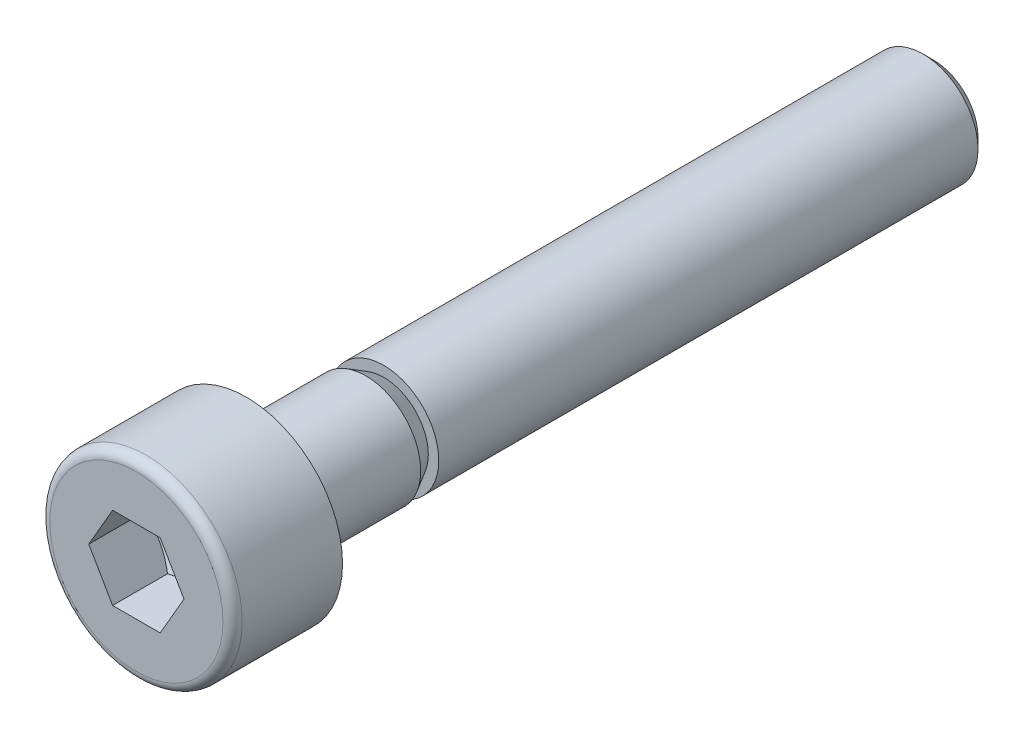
ISO-10303-21;
HEADER;
FILE_DESCRIPTION(('STEP AP214'),'2;1');
FILE_NAME('part.step','',(''),(''),'','','');
FILE_SCHEMA(('AUTOMOTIVE_DESIGN { 1 0 10303 214 1 1 1 1 }'));
ENDSEC;
DATA;
#1=APPLICATION_CONTEXT('core data for automotive mechanical design processes');
#2=APPLICATION_PROTOCOL_DEFINITION('international standard','automotive_design',2000,#1);
#3=PRODUCT_CONTEXT('',#1,'mechanical');
#4=PRODUCT('Part','Part','',(#3));
#5=PRODUCT_RELATED_PRODUCT_CATEGORY('part','',(#4));
#6=PRODUCT_DEFINITION_FORMATION('','',#4);
#7=PRODUCT_DEFINITION_CONTEXT('part definition',#1,'design');
#8=PRODUCT_DEFINITION('design','',#6,#7);
#9=PRODUCT_DEFINITION_SHAPE('','',#8);
#10=(LENGTH_UNIT() NAMED_UNIT(*) SI_UNIT(.MILLI.,.METRE.));
#11=(NAMED_UNIT(*) PLANE_ANGLE_UNIT() SI_UNIT($,.RADIAN.));
#12=(NAMED_UNIT(*) SI_UNIT($,.STERADIAN.) SOLID_ANGLE_UNIT());
#13=UNCERTAINTY_MEASURE_WITH_UNIT(LENGTH_MEASURE(1.E-05),#10,'distance_accuracy_value','');
#14=(GEOMETRIC_REPRESENTATION_CONTEXT(3) GLOBAL_UNCERTAINTY_ASSIGNED_CONTEXT((#13)) GLOBAL_UNIT_ASSIGNED_CONTEXT((#10,
#11,#12)) REPRESENTATION_CONTEXT('',''));
#15=CARTESIAN_POINT('',(0.,0.,0.));
#16=DIRECTION('',(0.,0.,1.));
#17=DIRECTION('',(1.,0.,0.));
#18=AXIS2_PLACEMENT_3D('',#15,#16,#17);
#19=CARTESIAN_POINT('',(0.,0.,4.));
#20=DIRECTION('',(0.,0.,1.));
#21=DIRECTION('',(1.,0.,0.));
#22=AXIS2_PLACEMENT_3D('',#19,#20,#21);
#23=PLANE('',#22);
#24=CARTESIAN_POINT('',(0.,0.,4.));
#25=DIRECTION('',(0.,0.,1.));
#26=DIRECTION('',(1.,0.,0.));
#27=AXIS2_PLACEMENT_3D('',#24,#25,#26);
#28=CIRCLE('',#27,3.15);
#29=CARTESIAN_POINT('',(3.15,0.,4.));
#30=VERTEX_POINT('',#29);
#31=EDGE_CURVE('E118',#30,#30,#28,.T.);
#32=ORIENTED_EDGE('',*,*,#31,.T.);
#33=EDGE_LOOP('',(#32));
#34=FACE_BOUND('',#33,.T.);
#35=DIRECTION('',(1.,0.,0.));
#36=VECTOR('',#35,1.);
#37=CARTESIAN_POINT('',(-0.866025,1.49999930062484,4.));
#38=LINE('',#37,#36);
#39=CARTESIAN_POINT('',(-0.866025,1.49999930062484,4.));
#40=VERTEX_POINT('',#39);
#41=CARTESIAN_POINT('',(0.866025,1.49999930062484,4.));
#42=VERTEX_POINT('',#41);
#43=EDGE_CURVE('E95',#40,#42,#38,.T.);
#44=ORIENTED_EDGE('',*,*,#43,.T.);
#45=DIRECTION('',(0.5,-0.866025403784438,0.));
#46=VECTOR('',#45,1.);
#47=CARTESIAN_POINT('',(0.866025,1.49999930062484,4.));
#48=LINE('',#47,#46);
#49=CARTESIAN_POINT('',(1.73205,0.,4.));
#50=VERTEX_POINT('',#49);
#51=EDGE_CURVE('E32',#42,#50,#48,.T.);
#52=ORIENTED_EDGE('',*,*,#51,.T.);
#53=DIRECTION('',(-0.5,-0.866025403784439,0.));
#54=VECTOR('',#53,1.);
#55=CARTESIAN_POINT('',(1.73205,0.,4.));
#56=LINE('',#55,#54);
#57=CARTESIAN_POINT('',(0.866025,-1.49999930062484,4.));
#58=VERTEX_POINT('',#57);
#59=EDGE_CURVE('E375',#50,#58,#56,.T.);
#60=ORIENTED_EDGE('',*,*,#59,.T.);
#61=DIRECTION('',(-1.,0.,0.));
#62=VECTOR('',#61,1.);
#63=CARTESIAN_POINT('',(0.866025,-1.49999930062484,4.));
#64=LINE('',#63,#62);
#65=CARTESIAN_POINT('',(-0.866025,-1.49999930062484,4.));
#66=VERTEX_POINT('',#65);
#67=EDGE_CURVE('E379',#58,#66,#64,.T.);
#68=ORIENTED_EDGE('',*,*,#67,.T.);
#69=DIRECTION('',(-0.5,0.866025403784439,0.));
#70=VECTOR('',#69,1.);
#71=CARTESIAN_POINT('',(-0.866025,-1.49999930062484,4.));
#72=LINE('',#71,#70);
#73=CARTESIAN_POINT('',(-1.73205,0.,4.));
#74=VERTEX_POINT('',#73);
#75=EDGE_CURVE('E383',#66,#74,#72,.T.);
#76=ORIENTED_EDGE('',*,*,#75,.T.);
#77=DIRECTION('',(0.5,0.866025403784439,0.));
#78=VECTOR('',#77,1.);
#79=CARTESIAN_POINT('',(-1.73205,0.,4.));
#80=LINE('',#79,#78);
#81=EDGE_CURVE('E104',#74,#40,#80,.T.);
#82=ORIENTED_EDGE('',*,*,#81,.T.);
#83=EDGE_LOOP('',(#44,#52,#60,#68,#76,#82));
#84=FACE_BOUND('',#83,.T.);
#85=ADVANCED_FACE('F16',(#34,#84),#23,.T.);
#86=CARTESIAN_POINT('',(0.,1.621125,-25.));
#87=DIRECTION('',(0.,0.,-1.));
#88=DIRECTION('',(-1.,0.,0.));
#89=AXIS2_PLACEMENT_3D('',#86,#87,#88);
#90=PLANE('',#89);
#91=CARTESIAN_POINT('',(0.,0.,-25.));
#92=DIRECTION('',(0.,0.,1.));
#93=DIRECTION('',(1.,0.,0.));
#94=AXIS2_PLACEMENT_3D('',#91,#92,#93);
#95=CIRCLE('',#94,1.621125);
#96=CARTESIAN_POINT('',(1.621125,0.,-25.));
#97=VERTEX_POINT('',#96);
#98=EDGE_CURVE('E11',#97,#97,#95,.T.);
#99=ORIENTED_EDGE('',*,*,#98,.F.);
#100=EDGE_LOOP('',(#99));
#101=FACE_BOUND('',#100,.T.);
#102=ADVANCED_FACE('F18',(#101),#90,.T.);
#103=CARTESIAN_POINT('',(0.,0.,-24.621125));
#104=DIRECTION('',(0.,0.,1.));
#105=DIRECTION('',(1.,0.,0.));
#106=AXIS2_PLACEMENT_3D('',#103,#104,#105);
#107=CONICAL_SURFACE('',#106,2.,0.785398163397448);
#108=ORIENTED_EDGE('',*,*,#98,.T.);
#109=EDGE_LOOP('',(#108));
#110=FACE_BOUND('',#109,.T.);
#111=CARTESIAN_POINT('',(0.,0.,-24.621125));
#112=DIRECTION('',(0.,0.,1.));
#113=DIRECTION('',(1.,0.,0.));
#114=AXIS2_PLACEMENT_3D('',#111,#112,#113);
#115=CIRCLE('',#114,2.);
#116=CARTESIAN_POINT('',(2.,0.,-24.621125));
#117=VERTEX_POINT('',#116);
#118=EDGE_CURVE('E25',#117,#117,#115,.T.);
#119=ORIENTED_EDGE('',*,*,#118,.F.);
#120=EDGE_LOOP('',(#119));
#121=FACE_BOUND('',#120,.T.);
#122=ADVANCED_FACE('F159',(#110,#121),#107,.T.);
#123=CARTESIAN_POINT('',(0.,0.,4.));
#124=DIRECTION('',(0.,0.,1.));
#125=DIRECTION('',(1.,0.,0.));
#126=AXIS2_PLACEMENT_3D('',#123,#124,#125);
#127=CYLINDRICAL_SURFACE('',#126,2.);
#128=ORIENTED_EDGE('',*,*,#118,.T.);
#129=EDGE_LOOP('',(#128));
#130=FACE_BOUND('',#129,.T.);
#131=CARTESIAN_POINT('',(0.,0.,-5.));
#132=DIRECTION('',(0.,0.,1.));
#133=DIRECTION('',(1.,0.,0.));
#134=AXIS2_PLACEMENT_3D('',#131,#132,#133);
#135=CIRCLE('',#134,2.);
#136=CARTESIAN_POINT('',(2.,0.,-5.));
#137=VERTEX_POINT('',#136);
#138=EDGE_CURVE('E146',#137,#137,#135,.T.);
#139=ORIENTED_EDGE('',*,*,#138,.F.);
#140=EDGE_LOOP('',(#139));
#141=FACE_BOUND('',#140,.T.);
#142=ADVANCED_FACE('F156',(#130,#141),#127,.T.);
#143=CARTESIAN_POINT('',(0.,1.621125,-5.));
#144=DIRECTION('',(0.,0.,1.));
#145=DIRECTION('',(1.,0.,0.));
#146=AXIS2_PLACEMENT_3D('',#143,#144,#145);
#147=PLANE('',#146);
#148=ORIENTED_EDGE('',*,*,#138,.T.);
#149=EDGE_LOOP('',(#148));
#150=FACE_BOUND('',#149,.T.);
#151=CARTESIAN_POINT('',(0.,0.,-5.));
#152=DIRECTION('',(0.,0.,1.));
#153=DIRECTION('',(1.,0.,0.));
#154=AXIS2_PLACEMENT_3D('',#151,#152,#153);
#155=CIRCLE('',#154,1.621125);
#156=CARTESIAN_POINT('',(1.621125,0.,-5.));
#157=VERTEX_POINT('',#156);
#158=EDGE_CURVE('E142',#157,#157,#155,.T.);
#159=ORIENTED_EDGE('',*,*,#158,.F.);
#160=EDGE_LOOP('',(#159));
#161=FACE_BOUND('',#160,.T.);
#162=ADVANCED_FACE('F167',(#150,#161),#147,.T.);
#163=CARTESIAN_POINT('',(0.,0.,-4.34376925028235));
#164=DIRECTION('',(0.,0.,1.));
#165=DIRECTION('',(1.,0.,0.));
#166=AXIS2_PLACEMENT_3D('',#163,#164,#165);
#167=CONICAL_SURFACE('',#166,2.,0.523598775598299);
#168=ORIENTED_EDGE('',*,*,#158,.T.);
#169=EDGE_LOOP('',(#168));
#170=FACE_BOUND('',#169,.T.);
#171=CARTESIAN_POINT('',(0.,0.,-4.34376925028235));
#172=DIRECTION('',(0.,0.,1.));
#173=DIRECTION('',(1.,0.,0.));
#174=AXIS2_PLACEMENT_3D('',#171,#172,#173);
#175=CIRCLE('',#174,2.);
#176=CARTESIAN_POINT('',(2.,0.,-4.34376925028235));
#177=VERTEX_POINT('',#176);
#178=EDGE_CURVE('E138',#177,#177,#175,.T.);
#179=ORIENTED_EDGE('',*,*,#178,.F.);
#180=EDGE_LOOP('',(#179));
#181=FACE_BOUND('',#180,.T.);
#182=ADVANCED_FACE('F199',(#170,#181),#167,.T.);
#183=CARTESIAN_POINT('',(0.,0.,4.));
#184=DIRECTION('',(0.,0.,1.));
#185=DIRECTION('',(1.,0.,0.));
#186=AXIS2_PLACEMENT_3D('',#183,#184,#185);
#187=CYLINDRICAL_SURFACE('',#186,2.);
#188=ORIENTED_EDGE('',*,*,#178,.T.);
#189=EDGE_LOOP('',(#188));
#190=FACE_BOUND('',#189,.T.);
#191=CARTESIAN_POINT('',(0.,0.,-0.2));
#192=DIRECTION('',(0.,0.,1.));
#193=DIRECTION('',(1.,0.,0.));
#194=AXIS2_PLACEMENT_3D('',#191,#192,#193);
#195=CIRCLE('',#194,2.);
#196=CARTESIAN_POINT('',(2.,0.,-0.2));
#197=VERTEX_POINT('',#196);
#198=EDGE_CURVE('E134',#197,#197,#195,.T.);
#199=ORIENTED_EDGE('',*,*,#198,.F.);
#200=EDGE_LOOP('',(#199));
#201=FACE_BOUND('',#200,.T.);
#202=ADVANCED_FACE('F195',(#190,#201),#187,.T.);
#203=CARTESIAN_POINT('',(0.,0.,-0.2));
#204=DIRECTION('',(0.,0.,1.));
#205=DIRECTION('',(1.,0.,0.));
#206=AXIS2_PLACEMENT_3D('',#203,#204,#205);
#207=TOROIDAL_SURFACE('',#206,2.2,0.2);
#208=ORIENTED_EDGE('',*,*,#198,.T.);
#209=EDGE_LOOP('',(#208));
#210=FACE_BOUND('',#209,.T.);
#211=CARTESIAN_POINT('',(0.,0.,0.));
#212=DIRECTION('',(0.,0.,1.));
#213=DIRECTION('',(1.,0.,0.));
#214=AXIS2_PLACEMENT_3D('',#211,#212,#213);
#215=CIRCLE('',#214,2.2);
#216=CARTESIAN_POINT('',(2.2,0.,0.));
#217=VERTEX_POINT('',#216);
#218=EDGE_CURVE('E130',#217,#217,#215,.T.);
#219=ORIENTED_EDGE('',*,*,#218,.F.);
#220=EDGE_LOOP('',(#219));
#221=FACE_BOUND('',#220,.T.);
#222=ADVANCED_FACE('F191',(#210,#221),#207,.F.);
#223=CARTESIAN_POINT('',(0.,3.5,0.));
#224=DIRECTION('',(0.,0.,-1.));
#225=DIRECTION('',(-1.,0.,0.));
#226=AXIS2_PLACEMENT_3D('',#223,#224,#225);
#227=PLANE('',#226);
#228=ORIENTED_EDGE('',*,*,#218,.T.);
#229=EDGE_LOOP('',(#228));
#230=FACE_BOUND('',#229,.T.);
#231=CARTESIAN_POINT('',(0.,0.,0.));
#232=DIRECTION('',(0.,0.,1.));
#233=DIRECTION('',(1.,0.,0.));
#234=AXIS2_PLACEMENT_3D('',#231,#232,#233);
#235=CIRCLE('',#234,3.5);
#236=CARTESIAN_POINT('',(3.5,0.,0.));
#237=VERTEX_POINT('',#236);
#238=EDGE_CURVE('E126',#237,#237,#235,.T.);
#239=ORIENTED_EDGE('',*,*,#238,.F.);
#240=EDGE_LOOP('',(#239));
#241=FACE_BOUND('',#240,.T.);
#242=ADVANCED_FACE('F187',(#230,#241),#227,.T.);
#243=CARTESIAN_POINT('',(0.,0.,4.));
#244=DIRECTION('',(0.,0.,1.));
#245=DIRECTION('',(1.,0.,0.));
#246=AXIS2_PLACEMENT_3D('',#243,#244,#245);
#247=CYLINDRICAL_SURFACE('',#246,3.5);
#248=ORIENTED_EDGE('',*,*,#238,.T.);
#249=EDGE_LOOP('',(#248));
#250=FACE_BOUND('',#249,.T.);
#251=CARTESIAN_POINT('',(0.,0.,3.65));
#252=DIRECTION('',(0.,0.,1.));
#253=DIRECTION('',(1.,0.,0.));
#254=AXIS2_PLACEMENT_3D('',#251,#252,#253);
#255=CIRCLE('',#254,3.5);
#256=CARTESIAN_POINT('',(3.5,0.,3.65));
#257=VERTEX_POINT('',#256);
#258=EDGE_CURVE('E122',#257,#257,#255,.T.);
#259=ORIENTED_EDGE('',*,*,#258,.F.);
#260=EDGE_LOOP('',(#259));
#261=FACE_BOUND('',#260,.T.);
#262=ADVANCED_FACE('F183',(#250,#261),#247,.T.);
#263=CARTESIAN_POINT('',(0.,0.,3.65));
#264=DIRECTION('',(0.,0.,1.));
#265=DIRECTION('',(1.,0.,0.));
#266=AXIS2_PLACEMENT_3D('',#263,#264,#265);
#267=TOROIDAL_SURFACE('',#266,3.15,0.35);
#268=ORIENTED_EDGE('',*,*,#31,.F.);
#269=EDGE_LOOP('',(#268));
#270=FACE_BOUND('',#269,.T.);
#271=ORIENTED_EDGE('',*,*,#258,.T.);
#272=EDGE_LOOP('',(#271));
#273=FACE_BOUND('',#272,.T.);
#274=ADVANCED_FACE('F180',(#270,#273),#267,.T.);
#275=CARTESIAN_POINT('',(0.866025,1.49999930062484,1.00000046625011));
#276=DIRECTION('',(-0.866025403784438,-0.5,0.));
#277=DIRECTION('',(-0.5,0.866025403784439,0.));
#278=AXIS2_PLACEMENT_3D('',#275,#276,#277);
#279=PLANE('',#278);
#280=DIRECTION('',(0.,0.,1.));
#281=VECTOR('',#280,1.);
#282=CARTESIAN_POINT('',(1.73205,0.,1.00000046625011));
#283=LINE('',#282,#281);
#284=CARTESIAN_POINT('',(1.73205,0.,2.));
#285=VERTEX_POINT('',#284);
#286=EDGE_CURVE('E116',#285,#50,#283,.T.);
#287=ORIENTED_EDGE('',*,*,#286,.T.);
#288=ORIENTED_EDGE('',*,*,#51,.F.);
#289=DIRECTION('',(0.,0.,1.));
#290=VECTOR('',#289,1.);
#291=CARTESIAN_POINT('',(0.866025,1.49999930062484,1.00000046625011));
#292=LINE('',#291,#290);
#293=CARTESIAN_POINT('',(0.866025,1.49999930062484,2.));
#294=VERTEX_POINT('',#293);
#295=EDGE_CURVE('E88',#294,#42,#292,.T.);
#296=ORIENTED_EDGE('',*,*,#295,.F.);
#297=CARTESIAN_POINT('',(1.73205115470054,-2.E-06,2.00000066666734));
#298=CARTESIAN_POINT('',(1.69399458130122,0.0659139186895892,1.97802228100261));
#299=CARTESIAN_POINT('',(1.65560950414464,0.132398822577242,1.95803408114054));
#300=CARTESIAN_POINT('',(1.57817473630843,0.266519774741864,1.92314525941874));
#301=CARTESIAN_POINT('',(1.53912367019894,0.334158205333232,1.90825697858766));
#302=CARTESIAN_POINT('',(1.46150547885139,0.468596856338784,1.88508226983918));
#303=CARTESIAN_POINT('',(1.42295029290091,0.535376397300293,1.87664158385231));
#304=CARTESIAN_POINT('',(1.34565859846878,0.669249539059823,1.86656700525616));
#305=CARTESIAN_POINT('',(1.30692237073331,0.736342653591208,1.86492476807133));
#306=CARTESIAN_POINT('',(1.23454773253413,0.861699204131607,1.86834969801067));
#307=CARTESIAN_POINT('',(1.20089846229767,0.919981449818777,1.87257593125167));
#308=CARTESIAN_POINT('',(1.1338191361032,1.03616625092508,1.88596796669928));
#309=CARTESIAN_POINT('',(1.10038931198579,1.09406840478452,1.89513833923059));
#310=CARTESIAN_POINT('',(1.03317179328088,1.21049256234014,1.91806252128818));
#311=CARTESIAN_POINT('',(0.999392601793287,1.26899983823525,1.93191346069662));
#312=CARTESIAN_POINT('',(0.932337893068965,1.38514200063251,1.96334924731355));
#313=CARTESIAN_POINT('',(0.89906151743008,1.4427783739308,1.980926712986));
#314=CARTESIAN_POINT('',(0.866023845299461,1.50000130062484,2.00000066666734));
#315=B_SPLINE_CURVE_WITH_KNOTS('',3,(#297,#298,#299,#300,#301,#302,#303,#304,#305,#306,#307,
#308,#309,#310,#311,#312,#313,#314),.UNSPECIFIED.,.F.,.F.,(4,2,2,2,2,2,2,2,4),(0.,
0.237762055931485,0.476095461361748,0.708530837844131,0.94068083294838,1.14278193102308,
1.34507017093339,1.55184422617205,1.75821246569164),.UNSPECIFIED.);
#316=EDGE_CURVE('E80',#285,#294,#315,.T.);
#317=ORIENTED_EDGE('',*,*,#316,.F.);
#318=EDGE_LOOP('',(#287,#288,#296,#317));
#319=FACE_BOUND('',#318,.T.);
#320=ADVANCED_FACE('F89',(#319),#279,.T.);
#321=CARTESIAN_POINT('',(1.73205,0.,1.00000046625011));
#322=DIRECTION('',(-0.866025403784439,0.5,0.));
#323=DIRECTION('',(0.5,0.866025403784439,0.));
#324=AXIS2_PLACEMENT_3D('',#321,#322,#323);
#325=PLANE('',#324);
#326=DIRECTION('',(0.,0.,1.));
#327=VECTOR('',#326,1.);
#328=CARTESIAN_POINT('',(0.866025,-1.49999930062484,1.00000046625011));
#329=LINE('',#328,#327);
#330=CARTESIAN_POINT('',(0.866025,-1.49999930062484,2.));
#331=VERTEX_POINT('',#330);
#332=EDGE_CURVE('E113',#331,#58,#329,.T.);
#333=ORIENTED_EDGE('',*,*,#332,.T.);
#334=ORIENTED_EDGE('',*,*,#59,.F.);
#335=ORIENTED_EDGE('',*,*,#286,.F.);
#336=CARTESIAN_POINT('',(0.866023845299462,-1.50000130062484,2.00000066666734));
#337=CARTESIAN_POINT('',(0.904080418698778,-1.43408538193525,1.9780222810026));
#338=CARTESIAN_POINT('',(0.942465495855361,-1.36760047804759,1.95803408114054));
#339=CARTESIAN_POINT('',(1.01990026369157,-1.23347952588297,1.92314525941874));
#340=CARTESIAN_POINT('',(1.05895132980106,-1.1658410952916,1.90825697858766));
#341=CARTESIAN_POINT('',(1.13656952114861,-1.03140244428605,1.88508226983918));
#342=CARTESIAN_POINT('',(1.1751247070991,-0.964622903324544,1.87664158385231));
#343=CARTESIAN_POINT('',(1.25241640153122,-0.830749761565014,1.86656700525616));
#344=CARTESIAN_POINT('',(1.29115262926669,-0.763656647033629,1.86492476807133));
#345=CARTESIAN_POINT('',(1.36352726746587,-0.638300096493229,1.86834969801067));
#346=CARTESIAN_POINT('',(1.39717653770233,-0.58001785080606,1.87257593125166));
#347=CARTESIAN_POINT('',(1.4642558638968,-0.463833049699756,1.88596796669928));
#348=CARTESIAN_POINT('',(1.49768568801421,-0.405930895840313,1.89513833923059));
#349=CARTESIAN_POINT('',(1.56490320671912,-0.2895067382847,1.91806252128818));
#350=CARTESIAN_POINT('',(1.59868239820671,-0.230999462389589,1.93191346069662));
#351=CARTESIAN_POINT('',(1.66573710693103,-0.11485729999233,1.96334924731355));
#352=CARTESIAN_POINT('',(1.69901348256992,-0.0572209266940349,1.980926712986));
#353=CARTESIAN_POINT('',(1.73205115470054,1.99999999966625E-06,2.00000066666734));
#354=B_SPLINE_CURVE_WITH_KNOTS('',3,(#336,#337,#338,#339,#340,#341,#342,#343,#344,#345,#346,
#347,#348,#349,#350,#351,#352,#353),.UNSPECIFIED.,.F.,.F.,(4,2,2,2,2,2,2,2,4),(0.,
0.237762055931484,0.476095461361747,0.708530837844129,0.940680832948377,1.14278193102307,
1.34507017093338,1.55184422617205,1.75821246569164),.UNSPECIFIED.);
#355=EDGE_CURVE('E84',#331,#285,#354,.T.);
#356=ORIENTED_EDGE('',*,*,#355,.F.);
#357=EDGE_LOOP('',(#333,#334,#335,#356));
#358=FACE_BOUND('',#357,.T.);
#359=ADVANCED_FACE('F264',(#358),#325,.T.);
#360=CARTESIAN_POINT('',(0.866025,-1.49999930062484,1.00000046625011));
#361=DIRECTION('',(0.,1.,0.));
#362=DIRECTION('',(1.,0.,0.));
#363=AXIS2_PLACEMENT_3D('',#360,#361,#362);
#364=PLANE('',#363);
#365=DIRECTION('',(0.,0.,1.));
#366=VECTOR('',#365,1.);
#367=CARTESIAN_POINT('',(-0.866025,-1.49999930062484,1.00000046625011));
#368=LINE('',#367,#366);
#369=CARTESIAN_POINT('',(-0.866025,-1.49999930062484,2.));
#370=VERTEX_POINT('',#369);
#371=EDGE_CURVE('E110',#370,#66,#368,.T.);
#372=ORIENTED_EDGE('',*,*,#371,.T.);
#373=ORIENTED_EDGE('',*,*,#67,.F.);
#374=ORIENTED_EDGE('',*,*,#332,.F.);
#375=CARTESIAN_POINT('',(-2.24271663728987,-1.49999930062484,2.55775267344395));
#376=CARTESIAN_POINT('',(-2.17794141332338,-1.49999930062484,2.52667596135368));
#377=CARTESIAN_POINT('',(-2.11300852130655,-1.49999930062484,2.49592211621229));
#378=CARTESIAN_POINT('',(-1.98274303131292,-1.49999930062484,2.43524311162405));
#379=CARTESIAN_POINT('',(-1.91741036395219,-1.49999930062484,2.40531810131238));
#380=CARTESIAN_POINT('',(-1.78588635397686,-1.49999930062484,2.34631254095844));
#381=CARTESIAN_POINT('',(-1.71969220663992,-1.49999930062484,2.31723821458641));
#382=CARTESIAN_POINT('',(-1.58674953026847,-1.49999930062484,2.26039396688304));
#383=CARTESIAN_POINT('',(-1.52000103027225,-1.49999930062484,2.23262397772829));
#384=CARTESIAN_POINT('',(-1.38408036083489,-1.49999930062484,2.17802545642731));
#385=CARTESIAN_POINT('',(-1.31489044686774,-1.49999930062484,2.1512405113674));
#386=CARTESIAN_POINT('',(-1.17568875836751,-1.49999930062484,2.09990652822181));
#387=CARTESIAN_POINT('',(-1.10567688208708,-1.49999930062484,2.07535777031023));
#388=CARTESIAN_POINT('',(-0.894522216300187,-1.49999930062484,2.0061010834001));
#389=CARTESIAN_POINT('',(-0.751873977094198,-1.49999930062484,1.9656202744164));
#390=CARTESIAN_POINT('',(-0.535047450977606,-1.49999930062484,1.9186645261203));
#391=CARTESIAN_POINT('',(-0.462365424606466,-1.49999930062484,1.90531291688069));
#392=CARTESIAN_POINT('',(-0.316183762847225,-1.49999930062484,1.8841134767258));
#393=CARTESIAN_POINT('',(-0.242684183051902,-1.49999930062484,1.87626527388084));
#394=CARTESIAN_POINT('',(-0.0961588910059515,-1.49999930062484,1.86679859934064));
#395=CARTESIAN_POINT('',(-0.0231380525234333,-1.49999930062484,1.86510661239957));
#396=CARTESIAN_POINT('',(0.122783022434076,-1.49999930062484,1.86789948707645));
#397=CARTESIAN_POINT('',(0.195683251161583,-1.49999930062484,1.8723847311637));
#398=CARTESIAN_POINT('',(0.375553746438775,-1.49999930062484,1.89067768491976));
#399=CARTESIAN_POINT('',(0.4821754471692,-1.49999930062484,1.90791354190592));
#400=CARTESIAN_POINT('',(0.693345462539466,-1.49999930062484,1.95235984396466));
#401=CARTESIAN_POINT('',(0.79789111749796,-1.49999930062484,1.97958231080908));
#402=CARTESIAN_POINT('',(0.954250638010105,-1.49999930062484,2.02608493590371));
#403=CARTESIAN_POINT('',(1.00687274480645,-1.49999930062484,2.04274751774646));
#404=CARTESIAN_POINT('',(1.11156919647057,-1.49999930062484,2.07761406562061));
#405=CARTESIAN_POINT('',(1.16364386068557,-1.49999930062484,2.09581706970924));
#406=CARTESIAN_POINT('',(1.26731501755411,-1.49999930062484,2.13350010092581));
#407=CARTESIAN_POINT('',(1.31891159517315,-1.49999930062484,2.15297989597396));
#408=CARTESIAN_POINT('',(1.42169818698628,-1.49999930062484,2.19300580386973));
#409=CARTESIAN_POINT('',(1.47288813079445,-1.49999930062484,2.21355209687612));
#410=CARTESIAN_POINT('',(1.6035520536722,-1.49999930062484,2.26731329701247));
#411=CARTESIAN_POINT('',(1.68276476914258,-1.49999930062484,2.30116251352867));
#412=CARTESIAN_POINT('',(1.84047488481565,-1.49999930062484,2.37049266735));
#413=CARTESIAN_POINT('',(1.9189722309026,-1.49999930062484,2.40597372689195));
#414=CARTESIAN_POINT('',(2.15362957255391,-1.49999930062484,2.51428942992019));
#415=CARTESIAN_POINT('',(2.3089286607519,-1.49999930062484,2.58898549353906));
#416=CARTESIAN_POINT('',(2.61820006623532,-1.49999930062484,2.74151036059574));
#417=CARTESIAN_POINT('',(2.77217051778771,-1.49999930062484,2.81934290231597));
#418=CARTESIAN_POINT('',(3.07905650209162,-1.49999930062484,2.97700931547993));
#419=CARTESIAN_POINT('',(3.23197216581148,-1.49999930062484,3.05684293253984));
#420=CARTESIAN_POINT('',(3.52267476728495,-1.49999930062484,3.21028853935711));
#421=CARTESIAN_POINT('',(3.66052737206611,-1.49999930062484,3.28377655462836));
#422=CARTESIAN_POINT('',(3.93578914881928,-1.49999930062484,3.43158990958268));
#423=CARTESIAN_POINT('',(4.07319830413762,-1.49999930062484,3.50591528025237));
#424=CARTESIAN_POINT('',(4.34732590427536,-1.49999930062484,3.65500351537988));
#425=CARTESIAN_POINT('',(4.48404521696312,-1.49999930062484,3.72976478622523));
#426=CARTESIAN_POINT('',(4.75720742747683,-1.49999930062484,3.87977391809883));
#427=CARTESIAN_POINT('',(4.89365033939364,-1.49999930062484,3.9550217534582));
#428=CARTESIAN_POINT('',(5.02999394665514,-1.49999930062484,4.03044801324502));
#429=B_SPLINE_CURVE_WITH_KNOTS('',3,(#375,#376,#377,#378,#379,#380,#381,#382,#383,#384,#385,
#386,#387,#388,#389,#390,#391,#392,#393,#394,#395,#396,#397,#398,#399,#400,#401,#402,#403,#404,
#405,#406,#407,#408,#409,#410,#411,#412,#413,#414,#415,#416,#417,#418,#419,#420,#421,#422,#423,
#424,#425,#426,#427,#428),.UNSPECIFIED.,.F.,.F.,(4,2,2,2,2,2,2,2,2,2,2,2,2,2,2,2,2,2,2,2,2,2,2,
2,2,2,4),(0.,0.215535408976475,0.431109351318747,0.647990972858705,0.864861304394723,
1.08740082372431,1.30996818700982,1.75384735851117,1.97537373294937,2.19688513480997,
2.41574248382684,2.63461338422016,2.95796620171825,3.28170955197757,3.44728283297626,
3.61275347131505,3.77819411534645,3.94366279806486,4.20206179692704,4.46048018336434,
4.97740230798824,5.49495989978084,6.01245202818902,6.48110050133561,6.94976637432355,
7.41724019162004,7.88468954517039),.UNSPECIFIED.);
#430=EDGE_CURVE('E330',#370,#331,#429,.T.);
#431=ORIENTED_EDGE('',*,*,#430,.F.);
#432=EDGE_LOOP('',(#372,#373,#374,#431));
#433=FACE_BOUND('',#432,.T.);
#434=ADVANCED_FACE('F271',(#433),#364,.T.);
#435=CARTESIAN_POINT('',(-0.866025,-1.49999930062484,1.00000046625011));
#436=DIRECTION('',(0.866025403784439,0.5,0.));
#437=DIRECTION('',(0.5,-0.866025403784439,0.));
#438=AXIS2_PLACEMENT_3D('',#435,#436,#437);
#439=PLANE('',#438);
#440=DIRECTION('',(0.,0.,1.));
#441=VECTOR('',#440,1.);
#442=CARTESIAN_POINT('',(-1.73205,0.,1.00000046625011));
#443=LINE('',#442,#441);
#444=CARTESIAN_POINT('',(-1.73205,0.,2.));
#445=VERTEX_POINT('',#444);
#446=EDGE_CURVE('E101',#445,#74,#443,.T.);
#447=ORIENTED_EDGE('',*,*,#446,.T.);
#448=ORIENTED_EDGE('',*,*,#75,.F.);
#449=ORIENTED_EDGE('',*,*,#371,.F.);
#450=CARTESIAN_POINT('',(-1.73205115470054,2.E-06,2.00000066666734));
#451=CARTESIAN_POINT('',(-1.69399458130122,-0.065913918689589,1.97802228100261));
#452=CARTESIAN_POINT('',(-1.65560950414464,-0.132398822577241,1.95803408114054));
#453=CARTESIAN_POINT('',(-1.57817473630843,-0.266519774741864,1.92314525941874));
#454=CARTESIAN_POINT('',(-1.53912367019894,-0.334158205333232,1.90825697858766));
#455=CARTESIAN_POINT('',(-1.46150547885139,-0.468596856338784,1.88508226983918));
#456=CARTESIAN_POINT('',(-1.42295029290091,-0.535376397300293,1.87664158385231));
#457=CARTESIAN_POINT('',(-1.34565859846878,-0.669249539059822,1.86656700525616));
#458=CARTESIAN_POINT('',(-1.30692237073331,-0.736342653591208,1.86492476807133));
#459=CARTESIAN_POINT('',(-1.23454773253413,-0.861699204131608,1.86834969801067));
#460=CARTESIAN_POINT('',(-1.20089846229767,-0.919981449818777,1.87257593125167));
#461=CARTESIAN_POINT('',(-1.1338191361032,-1.03616625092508,1.88596796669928));
#462=CARTESIAN_POINT('',(-1.10038931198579,-1.09406840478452,1.89513833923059));
#463=CARTESIAN_POINT('',(-1.03317179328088,-1.21049256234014,1.91806252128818));
#464=CARTESIAN_POINT('',(-0.999392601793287,-1.26899983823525,1.93191346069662));
#465=CARTESIAN_POINT('',(-0.932337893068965,-1.38514200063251,1.96334924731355));
#466=CARTESIAN_POINT('',(-0.89906151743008,-1.4427783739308,1.980926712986));
#467=CARTESIAN_POINT('',(-0.866023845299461,-1.50000130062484,2.00000066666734));
#468=B_SPLINE_CURVE_WITH_KNOTS('',3,(#450,#451,#452,#453,#454,#455,#456,#457,#458,#459,#460,
#461,#462,#463,#464,#465,#466,#467),.UNSPECIFIED.,.F.,.F.,(4,2,2,2,2,2,2,2,4),(0.,
0.237762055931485,0.476095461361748,0.708530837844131,0.94068083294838,1.14278193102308,
1.34507017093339,1.55184422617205,1.75821246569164),.UNSPECIFIED.);
#469=EDGE_CURVE('E323',#445,#370,#468,.T.);
#470=ORIENTED_EDGE('',*,*,#469,.F.);
#471=EDGE_LOOP('',(#447,#448,#449,#470));
#472=FACE_BOUND('',#471,.T.);
#473=ADVANCED_FACE('F279',(#472),#439,.T.);
#474=CARTESIAN_POINT('',(-1.73205,0.,1.00000046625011));
#475=DIRECTION('',(0.866025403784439,-0.5,0.));
#476=DIRECTION('',(-0.5,-0.866025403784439,0.));
#477=AXIS2_PLACEMENT_3D('',#474,#475,#476);
#478=PLANE('',#477);
#479=DIRECTION('',(0.,0.,1.));
#480=VECTOR('',#479,1.);
#481=CARTESIAN_POINT('',(-0.866025,1.49999930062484,1.00000046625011));
#482=LINE('',#481,#480);
#483=CARTESIAN_POINT('',(-0.866025,1.49999930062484,2.));
#484=VERTEX_POINT('',#483);
#485=EDGE_CURVE('E94',#484,#40,#482,.T.);
#486=ORIENTED_EDGE('',*,*,#485,.T.);
#487=ORIENTED_EDGE('',*,*,#81,.F.);
#488=ORIENTED_EDGE('',*,*,#446,.F.);
#489=CARTESIAN_POINT('',(-0.866023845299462,1.50000130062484,2.00000066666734));
#490=CARTESIAN_POINT('',(-0.904080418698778,1.43408538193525,1.9780222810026));
#491=CARTESIAN_POINT('',(-0.942465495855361,1.36760047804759,1.95803408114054));
#492=CARTESIAN_POINT('',(-1.01990026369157,1.23347952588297,1.92314525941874));
#493=CARTESIAN_POINT('',(-1.05895132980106,1.1658410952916,1.90825697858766));
#494=CARTESIAN_POINT('',(-1.13656952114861,1.03140244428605,1.88508226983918));
#495=CARTESIAN_POINT('',(-1.1751247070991,0.964622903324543,1.87664158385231));
#496=CARTESIAN_POINT('',(-1.25241640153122,0.830749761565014,1.86656700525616));
#497=CARTESIAN_POINT('',(-1.29115262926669,0.763656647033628,1.86492476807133));
#498=CARTESIAN_POINT('',(-1.36352726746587,0.638300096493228,1.86834969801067));
#499=CARTESIAN_POINT('',(-1.39717653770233,0.580017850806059,1.87257593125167));
#500=CARTESIAN_POINT('',(-1.4642558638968,0.463833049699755,1.88596796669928));
#501=CARTESIAN_POINT('',(-1.49768568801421,0.405930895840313,1.89513833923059));
#502=CARTESIAN_POINT('',(-1.56490320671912,0.289506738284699,1.91806252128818));
#503=CARTESIAN_POINT('',(-1.59868239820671,0.230999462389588,1.93191346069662));
#504=CARTESIAN_POINT('',(-1.66573710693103,0.11485729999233,1.96334924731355));
#505=CARTESIAN_POINT('',(-1.69901348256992,0.0572209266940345,1.980926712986));
#506=CARTESIAN_POINT('',(-1.73205115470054,-2.0000000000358E-06,2.00000066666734));
#507=B_SPLINE_CURVE_WITH_KNOTS('',3,(#489,#490,#491,#492,#493,#494,#495,#496,#497,#498,#499,
#500,#501,#502,#503,#504,#505,#506),.UNSPECIFIED.,.F.,.F.,(4,2,2,2,2,2,2,2,4),(0.,
0.237762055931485,0.476095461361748,0.70853083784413,0.940680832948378,1.14278193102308,
1.34507017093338,1.55184422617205,1.75821246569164),.UNSPECIFIED.);
#508=EDGE_CURVE('E40',#484,#445,#507,.T.);
#509=ORIENTED_EDGE('',*,*,#508,.F.);
#510=EDGE_LOOP('',(#486,#487,#488,#509));
#511=FACE_BOUND('',#510,.T.);
#512=ADVANCED_FACE('F288',(#511),#478,.T.);
#513=CARTESIAN_POINT('',(-0.866025,1.49999930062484,1.00000046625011));
#514=DIRECTION('',(0.,-1.,0.));
#515=DIRECTION('',(-1.,0.,0.));
#516=AXIS2_PLACEMENT_3D('',#513,#514,#515);
#517=PLANE('',#516);
#518=ORIENTED_EDGE('',*,*,#295,.T.);
#519=ORIENTED_EDGE('',*,*,#43,.F.);
#520=ORIENTED_EDGE('',*,*,#485,.F.);
#521=CARTESIAN_POINT('',(-2.24271663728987,1.49999930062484,2.55775267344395));
#522=CARTESIAN_POINT('',(-2.17794141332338,1.49999930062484,2.52667596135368));
#523=CARTESIAN_POINT('',(-2.11300852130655,1.49999930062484,2.49592211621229));
#524=CARTESIAN_POINT('',(-1.98274303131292,1.49999930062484,2.43524311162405));
#525=CARTESIAN_POINT('',(-1.91741036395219,1.49999930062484,2.40531810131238));
#526=CARTESIAN_POINT('',(-1.78588635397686,1.49999930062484,2.34631254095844));
#527=CARTESIAN_POINT('',(-1.71969220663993,1.49999930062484,2.31723821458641));
#528=CARTESIAN_POINT('',(-1.58674953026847,1.49999930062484,2.26039396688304));
#529=CARTESIAN_POINT('',(-1.52000103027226,1.49999930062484,2.23262397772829));
#530=CARTESIAN_POINT('',(-1.38408036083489,1.49999930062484,2.17802545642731));
#531=CARTESIAN_POINT('',(-1.31489044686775,1.49999930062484,2.1512405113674));
#532=CARTESIAN_POINT('',(-1.17568875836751,1.49999930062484,2.09990652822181));
#533=CARTESIAN_POINT('',(-1.10567688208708,1.49999930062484,2.07535777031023));
#534=CARTESIAN_POINT('',(-0.894522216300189,1.49999930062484,2.0061010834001));
#535=CARTESIAN_POINT('',(-0.7518739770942,1.49999930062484,1.9656202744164));
#536=CARTESIAN_POINT('',(-0.535047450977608,1.49999930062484,1.9186645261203));
#537=CARTESIAN_POINT('',(-0.462365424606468,1.49999930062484,1.90531291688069));
#538=CARTESIAN_POINT('',(-0.316183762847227,1.49999930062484,1.8841134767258));
#539=CARTESIAN_POINT('',(-0.242684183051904,1.49999930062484,1.87626527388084));
#540=CARTESIAN_POINT('',(-0.0961588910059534,1.49999930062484,1.86679859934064));
#541=CARTESIAN_POINT('',(-0.0231380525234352,1.49999930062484,1.86510661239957));
#542=CARTESIAN_POINT('',(0.122783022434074,1.49999930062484,1.86789948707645));
#543=CARTESIAN_POINT('',(0.195683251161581,1.49999930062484,1.8723847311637));
#544=CARTESIAN_POINT('',(0.375553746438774,1.49999930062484,1.89067768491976));
#545=CARTESIAN_POINT('',(0.482175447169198,1.49999930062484,1.90791354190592));
#546=CARTESIAN_POINT('',(0.693345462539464,1.49999930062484,1.95235984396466));
#547=CARTESIAN_POINT('',(0.797891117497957,1.49999930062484,1.97958231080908));
#548=CARTESIAN_POINT('',(0.954250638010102,1.49999930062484,2.02608493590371));
#549=CARTESIAN_POINT('',(1.00687274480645,1.49999930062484,2.04274751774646));
#550=CARTESIAN_POINT('',(1.11156919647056,1.49999930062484,2.07761406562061));
#551=CARTESIAN_POINT('',(1.16364386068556,1.49999930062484,2.09581706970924));
#552=CARTESIAN_POINT('',(1.2673150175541,1.49999930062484,2.13350010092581));
#553=CARTESIAN_POINT('',(1.31891159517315,1.49999930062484,2.15297989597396));
#554=CARTESIAN_POINT('',(1.42169818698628,1.49999930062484,2.19300580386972));
#555=CARTESIAN_POINT('',(1.47288813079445,1.49999930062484,2.21355209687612));
#556=CARTESIAN_POINT('',(1.60355205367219,1.49999930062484,2.26731329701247));
#557=CARTESIAN_POINT('',(1.68276476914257,1.49999930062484,2.30116251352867));
#558=CARTESIAN_POINT('',(1.84047488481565,1.49999930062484,2.37049266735));
#559=CARTESIAN_POINT('',(1.91897223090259,1.49999930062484,2.40597372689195));
#560=CARTESIAN_POINT('',(2.15362957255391,1.49999930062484,2.51428942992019));
#561=CARTESIAN_POINT('',(2.30892866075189,1.49999930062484,2.58898549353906));
#562=CARTESIAN_POINT('',(2.61820006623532,1.49999930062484,2.74151036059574));
#563=CARTESIAN_POINT('',(2.77217051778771,1.49999930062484,2.81934290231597));
#564=CARTESIAN_POINT('',(3.07905650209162,1.49999930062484,2.97700931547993));
#565=CARTESIAN_POINT('',(3.23197216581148,1.49999930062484,3.05684293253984));
#566=CARTESIAN_POINT('',(3.52267476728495,1.49999930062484,3.21028853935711));
#567=CARTESIAN_POINT('',(3.66052737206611,1.49999930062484,3.28377655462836));
#568=CARTESIAN_POINT('',(3.93578914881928,1.49999930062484,3.43158990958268));
#569=CARTESIAN_POINT('',(4.07319830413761,1.49999930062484,3.50591528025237));
#570=CARTESIAN_POINT('',(4.34732590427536,1.49999930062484,3.65500351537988));
#571=CARTESIAN_POINT('',(4.48404521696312,1.49999930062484,3.72976478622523));
#572=CARTESIAN_POINT('',(4.75720742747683,1.49999930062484,3.87977391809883));
#573=CARTESIAN_POINT('',(4.89365033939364,1.49999930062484,3.9550217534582));
#574=CARTESIAN_POINT('',(5.02999394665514,1.49999930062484,4.03044801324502));
#575=B_SPLINE_CURVE_WITH_KNOTS('',3,(#521,#522,#523,#524,#525,#526,#527,#528,#529,#530,#531,
#532,#533,#534,#535,#536,#537,#538,#539,#540,#541,#542,#543,#544,#545,#546,#547,#548,#549,#550,
#551,#552,#553,#554,#555,#556,#557,#558,#559,#560,#561,#562,#563,#564,#565,#566,#567,#568,#569,
#570,#571,#572,#573,#574),.UNSPECIFIED.,.F.,.F.,(4,2,2,2,2,2,2,2,2,2,2,2,2,2,2,2,2,2,2,2,2,2,2,
2,2,2,4),(0.,0.215535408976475,0.431109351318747,0.647990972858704,0.864861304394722,
1.0874008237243,1.30996818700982,1.75384735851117,1.97537373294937,2.19688513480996,
2.41574248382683,2.63461338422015,2.95796620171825,3.28170955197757,3.44728283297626,
3.61275347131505,3.77819411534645,3.94366279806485,4.20206179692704,4.46048018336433,
4.97740230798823,5.49495989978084,6.01245202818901,6.48110050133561,6.94976637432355,
7.41724019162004,7.88468954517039),.UNSPECIFIED.);
#576=EDGE_CURVE('E81',#294,#484,#575,.F.);
#577=ORIENTED_EDGE('',*,*,#576,.F.);
#578=EDGE_LOOP('',(#518,#519,#520,#577));
#579=FACE_BOUND('',#578,.T.);
#580=ADVANCED_FACE('F76',(#579),#517,.T.);
#581=CARTESIAN_POINT('',(0.,0.,1.00000046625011));
#582=DIRECTION('',(0.,0.,1.));
#583=DIRECTION('',(1.,0.,0.));
#584=AXIS2_PLACEMENT_3D('',#581,#582,#583);
#585=CONICAL_SURFACE('',#584,0.,1.0471975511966);
#586=CARTESIAN_POINT('',(0.,0.,1.00000046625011));
#587=VERTEX_POINT('',#586);
#588=VERTEX_LOOP('',#587);
#589=FACE_BOUND('',#588,.T.);
#590=ORIENTED_EDGE('',*,*,#316,.T.);
#591=ORIENTED_EDGE('',*,*,#576,.T.);
#592=ORIENTED_EDGE('',*,*,#508,.T.);
#593=ORIENTED_EDGE('',*,*,#469,.T.);
#594=ORIENTED_EDGE('',*,*,#430,.T.);
#595=ORIENTED_EDGE('',*,*,#355,.T.);
#596=EDGE_LOOP('',(#590,#591,#592,#593,#594,#595));
#597=FACE_BOUND('',#596,.T.);
#598=ADVANCED_FACE('F73',(#589,#597),#585,.F.);
#599=CLOSED_SHELL('',(#85,#102,#122,#142,#162,#182,#202,#222,#242,#262,#274,#320,#359,#434,#473,
#512,#580,#598));
#600=MANIFOLD_SOLID_BREP('B1',#599);
#601=ADVANCED_BREP_SHAPE_REPRESENTATION('',(#18,#600),#14);
#602=SHAPE_DEFINITION_REPRESENTATION(#9,#601);
ENDSEC;
END-ISO-10303-21;
